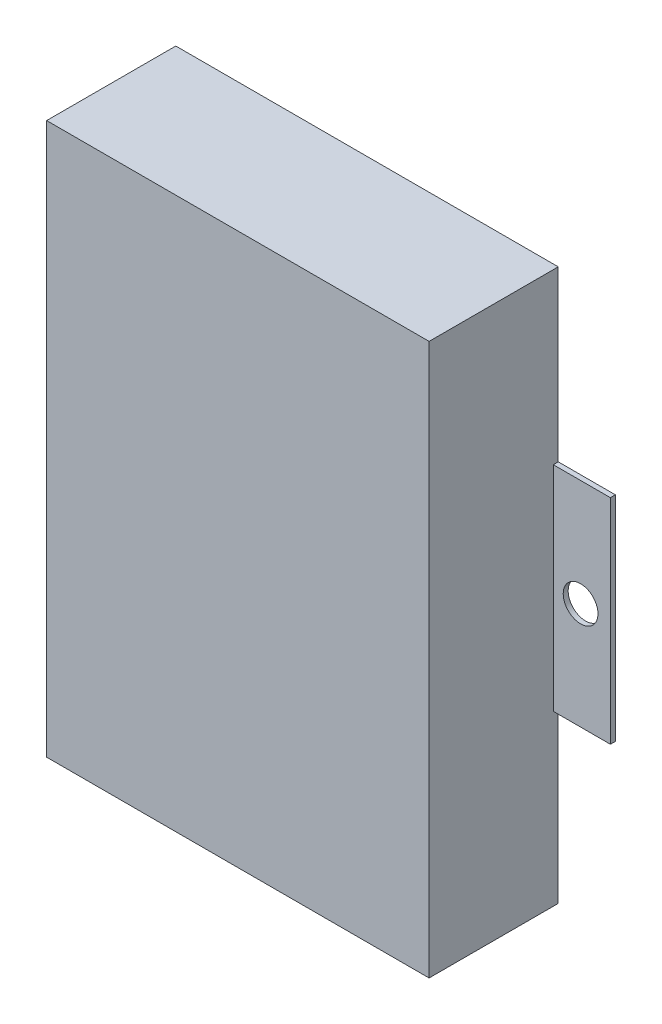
from build123d import *

# Parameters (mm, degrees)
ESQUISSE1_W      = 77
ESQUISSE1_H      = 111
EXTRUSION1_DEPTH = 26
ESQUISSE4_W      = 11.5
ESQUISSE4_H      = 43
ESQUISSE4_R      = 3.5
EXTRUSION2_DEPTH = 1


with BuildPart() as part:
    # Esquisse1 → Extrusion1 (new body)
    with BuildSketch(Plane.XY):
        with Locations((38.5, 55.5)):
            Rectangle(ESQUISSE1_W, ESQUISSE1_H)
    extrude(amount=EXTRUSION1_DEPTH)

    # Esquisse4 → Extrusion2 (add)
    # profile 1 of 2: a face of its own
    with BuildSketch(Plane(origin=(0, 0, 0), x_dir=(-1, 0, 0), z_dir=(0, 0, -1))):
        with Locations((-82.75, 55.5)):
            Rectangle(ESQUISSE4_W, ESQUISSE4_H)
        with Locations((-82.5, 55.5)):
            Circle(ESQUISSE4_R, mode=Mode.SUBTRACT)
    # profile 2 of 2: a face of its own
    with BuildSketch(Plane(origin=(0, 0, 0), x_dir=(-1, 0, 0), z_dir=(0, 0, -1))):
        with Locations((5.75, 55.5)):
            Rectangle(ESQUISSE4_W, ESQUISSE4_H)
        with Locations((5.5, 55.5)):
            Circle(ESQUISSE4_R, mode=Mode.SUBTRACT)
    extrude(amount=-EXTRUSION2_DEPTH)


solid = part.part
